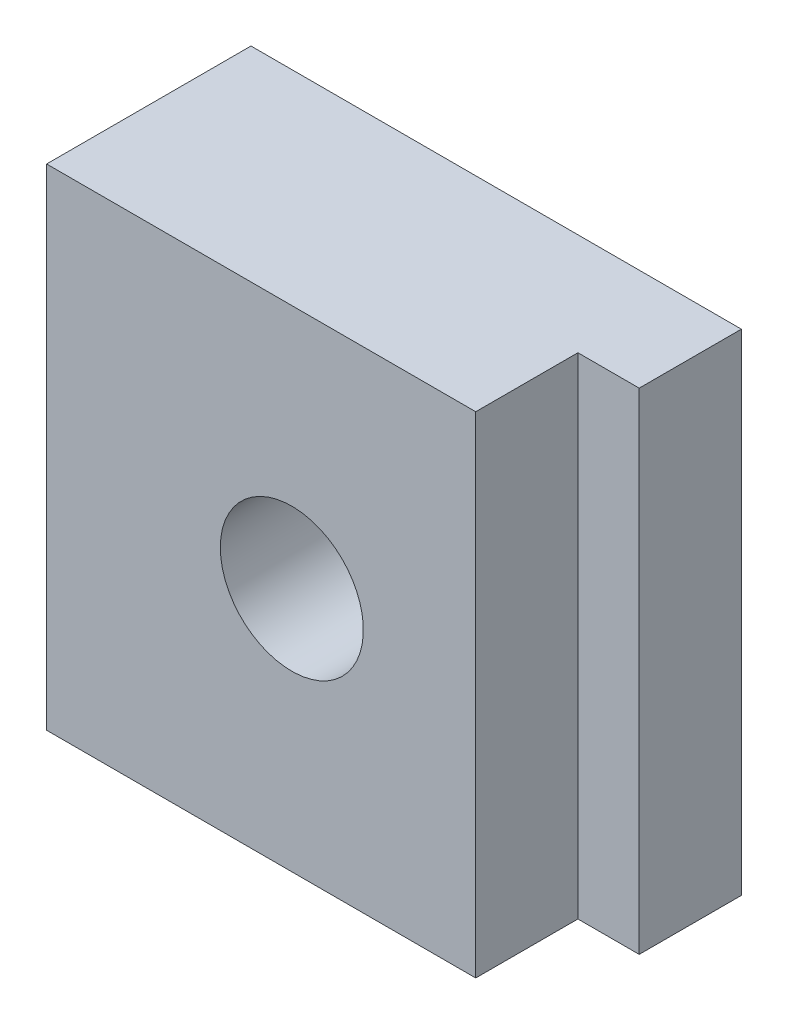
ISO-10303-21;
HEADER;
FILE_DESCRIPTION(('STEP AP214'),'2;1');
FILE_NAME('part.step','',(''),(''),'','','');
FILE_SCHEMA(('AUTOMOTIVE_DESIGN { 1 0 10303 214 1 1 1 1 }'));
ENDSEC;
DATA;
#1=APPLICATION_CONTEXT('core data for automotive mechanical design processes');
#2=APPLICATION_PROTOCOL_DEFINITION('international standard','automotive_design',2000,#1);
#3=PRODUCT_CONTEXT('',#1,'mechanical');
#4=PRODUCT('Part','Part','',(#3));
#5=PRODUCT_RELATED_PRODUCT_CATEGORY('part','',(#4));
#6=PRODUCT_DEFINITION_FORMATION('','',#4);
#7=PRODUCT_DEFINITION_CONTEXT('part definition',#1,'design');
#8=PRODUCT_DEFINITION('design','',#6,#7);
#9=PRODUCT_DEFINITION_SHAPE('','',#8);
#10=(LENGTH_UNIT() NAMED_UNIT(*) SI_UNIT(.MILLI.,.METRE.));
#11=(NAMED_UNIT(*) PLANE_ANGLE_UNIT() SI_UNIT($,.RADIAN.));
#12=(NAMED_UNIT(*) SI_UNIT($,.STERADIAN.) SOLID_ANGLE_UNIT());
#13=UNCERTAINTY_MEASURE_WITH_UNIT(LENGTH_MEASURE(1.E-05),#10,'distance_accuracy_value','');
#14=(GEOMETRIC_REPRESENTATION_CONTEXT(3) GLOBAL_UNCERTAINTY_ASSIGNED_CONTEXT((#13)) GLOBAL_UNIT_ASSIGNED_CONTEXT((#10,
#11,#12)) REPRESENTATION_CONTEXT('',''));
#15=CARTESIAN_POINT('',(0.,0.,0.));
#16=DIRECTION('',(0.,0.,1.));
#17=DIRECTION('',(1.,0.,0.));
#18=AXIS2_PLACEMENT_3D('',#15,#16,#17);
#19=CARTESIAN_POINT('',(-6.00000000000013,6.00000000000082,2.50000000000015));
#20=DIRECTION('',(0.,0.,-1.));
#21=DIRECTION('',(-1.,0.,0.));
#22=AXIS2_PLACEMENT_3D('',#19,#20,#21);
#23=PLANE('',#22);
#24=DIRECTION('',(1.,0.,0.));
#25=VECTOR('',#24,1.);
#26=CARTESIAN_POINT('',(-5.99999999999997,-5.99999999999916,2.5));
#27=LINE('',#26,#25);
#28=CARTESIAN_POINT('',(-5.99999999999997,-5.99999999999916,2.5));
#29=VERTEX_POINT('',#28);
#30=CARTESIAN_POINT('',(4.50000000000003,-5.99999999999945,2.49999999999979));
#31=VERTEX_POINT('',#30);
#32=EDGE_CURVE('E93',#29,#31,#27,.T.);
#33=ORIENTED_EDGE('',*,*,#32,.T.);
#34=DIRECTION('',(0.,-1.,0.));
#35=VECTOR('',#34,1.);
#36=CARTESIAN_POINT('',(4.49999999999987,6.00000000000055,2.49999999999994));
#37=LINE('',#36,#35);
#38=CARTESIAN_POINT('',(4.49999999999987,6.00000000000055,2.49999999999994));
#39=VERTEX_POINT('',#38);
#40=EDGE_CURVE('E11',#39,#31,#37,.T.);
#41=ORIENTED_EDGE('',*,*,#40,.F.);
#42=DIRECTION('',(1.,0.,0.));
#43=VECTOR('',#42,1.);
#44=CARTESIAN_POINT('',(-6.00000000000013,6.00000000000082,2.50000000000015));
#45=LINE('',#44,#43);
#46=CARTESIAN_POINT('',(-6.00000000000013,6.00000000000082,2.50000000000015));
#47=VERTEX_POINT('',#46);
#48=EDGE_CURVE('E122',#47,#39,#45,.T.);
#49=ORIENTED_EDGE('',*,*,#48,.F.);
#50=DIRECTION('',(0.,-1.,0.));
#51=VECTOR('',#50,1.);
#52=CARTESIAN_POINT('',(-6.00000000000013,6.00000000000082,2.50000000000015));
#53=LINE('',#52,#51);
#54=EDGE_CURVE('E107',#47,#29,#53,.T.);
#55=ORIENTED_EDGE('',*,*,#54,.T.);
#56=EDGE_LOOP('',(#33,#41,#49,#55));
#57=FACE_BOUND('',#56,.T.);
#58=CARTESIAN_POINT('',(0.,0.,2.50000000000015));
#59=DIRECTION('',(0.,0.,-1.));
#60=DIRECTION('',(-1.,0.,0.));
#61=AXIS2_PLACEMENT_3D('',#58,#59,#60);
#62=CIRCLE('',#61,1.75);
#63=CARTESIAN_POINT('',(-1.75000000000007,0.,2.50000000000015));
#64=VERTEX_POINT('',#63);
#65=EDGE_CURVE('E108',#64,#64,#62,.T.);
#66=ORIENTED_EDGE('',*,*,#65,.T.);
#67=EDGE_LOOP('',(#66));
#68=FACE_BOUND('',#67,.T.);
#69=ADVANCED_FACE('F37',(#57,#68),#23,.F.);
#70=CARTESIAN_POINT('',(4.49999999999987,6.00000000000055,2.49999999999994));
#71=DIRECTION('',(-1.,0.,0.));
#72=DIRECTION('',(0.,0.,1.));
#73=AXIS2_PLACEMENT_3D('',#70,#71,#72);
#74=PLANE('',#73);
#75=DIRECTION('',(0.,0.,-1.));
#76=VECTOR('',#75,1.);
#77=CARTESIAN_POINT('',(4.50000000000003,-5.99999999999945,2.49999999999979));
#78=LINE('',#77,#76);
#79=CARTESIAN_POINT('',(4.50000000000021,-5.99999999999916,-2.08166817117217E-13));
#80=VERTEX_POINT('',#79);
#81=EDGE_CURVE('E89',#31,#80,#78,.T.);
#82=ORIENTED_EDGE('',*,*,#81,.T.);
#83=DIRECTION('',(0.,-1.,0.));
#84=VECTOR('',#83,1.);
#85=CARTESIAN_POINT('',(4.5,6.00000000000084,0.));
#86=LINE('',#85,#84);
#87=CARTESIAN_POINT('',(4.5,6.00000000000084,0.));
#88=VERTEX_POINT('',#87);
#89=EDGE_CURVE('E44',#88,#80,#86,.T.);
#90=ORIENTED_EDGE('',*,*,#89,.F.);
#91=DIRECTION('',(0.,0.,-1.));
#92=VECTOR('',#91,1.);
#93=CARTESIAN_POINT('',(4.49999999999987,6.00000000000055,2.49999999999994));
#94=LINE('',#93,#92);
#95=EDGE_CURVE('E102',#39,#88,#94,.T.);
#96=ORIENTED_EDGE('',*,*,#95,.F.);
#97=ORIENTED_EDGE('',*,*,#40,.T.);
#98=EDGE_LOOP('',(#82,#90,#96,#97));
#99=FACE_BOUND('',#98,.T.);
#100=ADVANCED_FACE('F101',(#99),#74,.F.);
#101=CARTESIAN_POINT('',(4.5,6.00000000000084,0.));
#102=DIRECTION('',(0.,0.,-1.));
#103=DIRECTION('',(-1.,0.,0.));
#104=AXIS2_PLACEMENT_3D('',#101,#102,#103);
#105=PLANE('',#104);
#106=DIRECTION('',(1.,0.,0.));
#107=VECTOR('',#106,1.);
#108=CARTESIAN_POINT('',(4.50000000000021,-5.99999999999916,-2.08166817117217E-13));
#109=LINE('',#108,#107);
#110=CARTESIAN_POINT('',(5.99999999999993,-6.00000000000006,-2.08166817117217E-13));
#111=VERTEX_POINT('',#110);
#112=EDGE_CURVE('E95',#80,#111,#109,.T.);
#113=ORIENTED_EDGE('',*,*,#112,.T.);
#114=DIRECTION('',(0.,-1.,0.));
#115=VECTOR('',#114,1.);
#116=CARTESIAN_POINT('',(6.00000000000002,5.99999999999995,0.));
#117=LINE('',#116,#115);
#118=CARTESIAN_POINT('',(6.00000000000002,5.99999999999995,0.));
#119=VERTEX_POINT('',#118);
#120=EDGE_CURVE('E138',#119,#111,#117,.T.);
#121=ORIENTED_EDGE('',*,*,#120,.F.);
#122=DIRECTION('',(1.,0.,0.));
#123=VECTOR('',#122,1.);
#124=CARTESIAN_POINT('',(4.5,6.00000000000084,0.));
#125=LINE('',#124,#123);
#126=EDGE_CURVE('E125',#88,#119,#125,.T.);
#127=ORIENTED_EDGE('',*,*,#126,.F.);
#128=ORIENTED_EDGE('',*,*,#89,.T.);
#129=EDGE_LOOP('',(#113,#121,#127,#128));
#130=FACE_BOUND('',#129,.T.);
#131=ADVANCED_FACE('F142',(#130),#105,.F.);
#132=CARTESIAN_POINT('',(5.9999999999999,5.99999999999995,-2.50000000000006));
#133=DIRECTION('',(-1.,0.,0.));
#134=DIRECTION('',(0.,0.,1.));
#135=AXIS2_PLACEMENT_3D('',#132,#133,#134);
#136=PLANE('',#135);
#137=DIRECTION('',(0.,0.,-1.));
#138=VECTOR('',#137,1.);
#139=CARTESIAN_POINT('',(5.99999999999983,-6.00000000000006,-2.50000000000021));
#140=LINE('',#139,#138);
#141=CARTESIAN_POINT('',(5.99999999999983,-6.00000000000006,-2.50000000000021));
#142=VERTEX_POINT('',#141);
#143=EDGE_CURVE('E116',#111,#142,#140,.T.);
#144=ORIENTED_EDGE('',*,*,#143,.T.);
#145=DIRECTION('',(0.,-1.,0.));
#146=VECTOR('',#145,1.);
#147=CARTESIAN_POINT('',(5.9999999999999,5.99999999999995,-2.50000000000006));
#148=LINE('',#147,#146);
#149=CARTESIAN_POINT('',(5.9999999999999,5.99999999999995,-2.50000000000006));
#150=VERTEX_POINT('',#149);
#151=EDGE_CURVE('E135',#150,#142,#148,.T.);
#152=ORIENTED_EDGE('',*,*,#151,.F.);
#153=DIRECTION('',(0.,0.,-1.));
#154=VECTOR('',#153,1.);
#155=CARTESIAN_POINT('',(5.9999999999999,5.99999999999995,-2.50000000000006));
#156=LINE('',#155,#154);
#157=EDGE_CURVE('E127',#119,#150,#156,.T.);
#158=ORIENTED_EDGE('',*,*,#157,.F.);
#159=ORIENTED_EDGE('',*,*,#120,.T.);
#160=EDGE_LOOP('',(#144,#152,#158,#159));
#161=FACE_BOUND('',#160,.T.);
#162=ADVANCED_FACE('F148',(#161),#136,.F.);
#163=CARTESIAN_POINT('',(5.9999999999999,5.99999999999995,-2.50000000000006));
#164=DIRECTION('',(0.,0.,1.));
#165=DIRECTION('',(1.,0.,0.));
#166=AXIS2_PLACEMENT_3D('',#163,#164,#165);
#167=PLANE('',#166);
#168=CARTESIAN_POINT('',(0.,0.,-2.49999999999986));
#169=DIRECTION('',(0.,0.,1.));
#170=DIRECTION('',(1.,0.,0.));
#171=AXIS2_PLACEMENT_3D('',#168,#169,#170);
#172=CIRCLE('',#171,3.);
#173=CARTESIAN_POINT('',(3.,0.,-2.49999999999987));
#174=VERTEX_POINT('',#173);
#175=EDGE_CURVE('E241',#174,#174,#172,.F.);
#176=ORIENTED_EDGE('',*,*,#175,.F.);
#177=EDGE_LOOP('',(#176));
#178=FACE_BOUND('',#177,.T.);
#179=DIRECTION('',(-1.,0.,0.));
#180=VECTOR('',#179,1.);
#181=CARTESIAN_POINT('',(5.99999999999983,-6.00000000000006,-2.50000000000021));
#182=LINE('',#181,#180);
#183=CARTESIAN_POINT('',(-5.99999999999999,-5.99999999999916,-2.5));
#184=VERTEX_POINT('',#183);
#185=EDGE_CURVE('E118',#142,#184,#182,.T.);
#186=ORIENTED_EDGE('',*,*,#185,.T.);
#187=DIRECTION('',(0.,-1.,0.));
#188=VECTOR('',#187,1.);
#189=CARTESIAN_POINT('',(-6.0000000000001,6.00000000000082,-2.49999999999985));
#190=LINE('',#189,#188);
#191=CARTESIAN_POINT('',(-6.0000000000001,6.00000000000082,-2.49999999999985));
#192=VERTEX_POINT('',#191);
#193=EDGE_CURVE('E132',#192,#184,#190,.T.);
#194=ORIENTED_EDGE('',*,*,#193,.F.);
#195=DIRECTION('',(-1.,0.,0.));
#196=VECTOR('',#195,1.);
#197=CARTESIAN_POINT('',(5.9999999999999,5.99999999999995,-2.50000000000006));
#198=LINE('',#197,#196);
#199=EDGE_CURVE('E56',#150,#192,#198,.T.);
#200=ORIENTED_EDGE('',*,*,#199,.F.);
#201=ORIENTED_EDGE('',*,*,#151,.T.);
#202=EDGE_LOOP('',(#186,#194,#200,#201));
#203=FACE_BOUND('',#202,.T.);
#204=ADVANCED_FACE('F151',(#178,#203),#167,.F.);
#205=CARTESIAN_POINT('',(-6.0000000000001,6.00000000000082,-2.49999999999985));
#206=DIRECTION('',(1.,0.,0.));
#207=DIRECTION('',(0.,0.,-1.));
#208=AXIS2_PLACEMENT_3D('',#205,#206,#207);
#209=PLANE('',#208);
#210=DIRECTION('',(0.,0.,1.));
#211=VECTOR('',#210,1.);
#212=CARTESIAN_POINT('',(-5.99999999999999,-5.99999999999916,-2.5));
#213=LINE('',#212,#211);
#214=EDGE_CURVE('E120',#184,#29,#213,.T.);
#215=ORIENTED_EDGE('',*,*,#214,.T.);
#216=ORIENTED_EDGE('',*,*,#54,.F.);
#217=DIRECTION('',(0.,0.,1.));
#218=VECTOR('',#217,1.);
#219=CARTESIAN_POINT('',(-6.0000000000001,6.00000000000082,-2.49999999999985));
#220=LINE('',#219,#218);
#221=EDGE_CURVE('E51',#192,#47,#220,.T.);
#222=ORIENTED_EDGE('',*,*,#221,.F.);
#223=ORIENTED_EDGE('',*,*,#193,.T.);
#224=EDGE_LOOP('',(#215,#216,#222,#223));
#225=FACE_BOUND('',#224,.T.);
#226=ADVANCED_FACE('F153',(#225),#209,.F.);
#227=CARTESIAN_POINT('',(4.49999999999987,6.00000000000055,2.49999999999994));
#228=DIRECTION('',(0.,1.,0.));
#229=DIRECTION('',(0.,0.,1.));
#230=AXIS2_PLACEMENT_3D('',#227,#228,#229);
#231=PLANE('',#230);
#232=ORIENTED_EDGE('',*,*,#48,.T.);
#233=ORIENTED_EDGE('',*,*,#95,.T.);
#234=ORIENTED_EDGE('',*,*,#126,.T.);
#235=ORIENTED_EDGE('',*,*,#157,.T.);
#236=ORIENTED_EDGE('',*,*,#199,.T.);
#237=ORIENTED_EDGE('',*,*,#221,.T.);
#238=EDGE_LOOP('',(#232,#233,#234,#235,#236,#237));
#239=FACE_BOUND('',#238,.T.);
#240=ADVANCED_FACE('F145',(#239),#231,.T.);
#241=CARTESIAN_POINT('',(4.50000000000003,-5.99999999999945,2.49999999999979));
#242=DIRECTION('',(0.,1.,0.));
#243=DIRECTION('',(0.,0.,1.));
#244=AXIS2_PLACEMENT_3D('',#241,#242,#243);
#245=PLANE('',#244);
#246=ORIENTED_EDGE('',*,*,#32,.F.);
#247=ORIENTED_EDGE('',*,*,#214,.F.);
#248=ORIENTED_EDGE('',*,*,#185,.F.);
#249=ORIENTED_EDGE('',*,*,#143,.F.);
#250=ORIENTED_EDGE('',*,*,#112,.F.);
#251=ORIENTED_EDGE('',*,*,#81,.F.);
#252=EDGE_LOOP('',(#246,#247,#248,#249,#250,#251));
#253=FACE_BOUND('',#252,.T.);
#254=ADVANCED_FACE('F90',(#253),#245,.F.);
#255=CARTESIAN_POINT('',(0.,0.,7.44974746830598));
#256=DIRECTION('',(0.,0.,-1.));
#257=DIRECTION('',(-1.,0.,0.));
#258=AXIS2_PLACEMENT_3D('',#255,#256,#257);
#259=CYLINDRICAL_SURFACE('',#258,1.75);
#260=ORIENTED_EDGE('',*,*,#65,.F.);
#261=EDGE_LOOP('',(#260));
#262=FACE_BOUND('',#261,.T.);
#263=CARTESIAN_POINT('',(0.,0.,1.45716771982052E-13));
#264=DIRECTION('',(0.,0.,1.));
#265=DIRECTION('',(1.,0.,0.));
#266=AXIS2_PLACEMENT_3D('',#263,#264,#265);
#267=CIRCLE('',#266,1.75);
#268=CARTESIAN_POINT('',(1.74999999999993,0.,1.40147251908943E-13));
#269=VERTEX_POINT('',#268);
#270=EDGE_CURVE('E111',#269,#269,#267,.T.);
#271=ORIENTED_EDGE('',*,*,#270,.F.);
#272=EDGE_LOOP('',(#271));
#273=FACE_BOUND('',#272,.T.);
#274=ADVANCED_FACE('F200',(#262,#273),#259,.F.);
#275=CARTESIAN_POINT('',(0.,0.,-10.9852813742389));
#276=DIRECTION('',(0.,0.,1.));
#277=DIRECTION('',(1.,0.,0.));
#278=AXIS2_PLACEMENT_3D('',#275,#276,#277);
#279=CYLINDRICAL_SURFACE('',#278,3.);
#280=ORIENTED_EDGE('',*,*,#175,.T.);
#281=EDGE_LOOP('',(#280));
#282=FACE_BOUND('',#281,.T.);
#283=CARTESIAN_POINT('',(0.,0.,1.45716771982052E-13));
#284=DIRECTION('',(0.,0.,1.));
#285=DIRECTION('',(1.,0.,0.));
#286=AXIS2_PLACEMENT_3D('',#283,#284,#285);
#287=CIRCLE('',#286,3.);
#288=CARTESIAN_POINT('',(2.99999999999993,0.,1.36169023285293E-13));
#289=VERTEX_POINT('',#288);
#290=EDGE_CURVE('E239',#289,#289,#287,.T.);
#291=ORIENTED_EDGE('',*,*,#290,.T.);
#292=EDGE_LOOP('',(#291));
#293=FACE_BOUND('',#292,.T.);
#294=ADVANCED_FACE('F210',(#282,#293),#279,.F.);
#295=CARTESIAN_POINT('',(0.,0.,1.45716771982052E-13));
#296=DIRECTION('',(0.,0.,1.));
#297=DIRECTION('',(1.,0.,0.));
#298=AXIS2_PLACEMENT_3D('',#295,#296,#297);
#299=PLANE('',#298);
#300=ORIENTED_EDGE('',*,*,#270,.T.);
#301=EDGE_LOOP('',(#300));
#302=FACE_BOUND('',#301,.T.);
#303=ORIENTED_EDGE('',*,*,#290,.F.);
#304=EDGE_LOOP('',(#303));
#305=FACE_BOUND('',#304,.T.);
#306=ADVANCED_FACE('F220',(#302,#305),#299,.F.);
#307=CLOSED_SHELL('',(#69,#100,#131,#162,#204,#226,#240,#254,#274,#294,#306));
#308=MANIFOLD_SOLID_BREP('B2',#307);
#309=ADVANCED_BREP_SHAPE_REPRESENTATION('',(#18,#308),#14);
#310=SHAPE_DEFINITION_REPRESENTATION(#9,#309);
ENDSEC;
END-ISO-10303-21;
